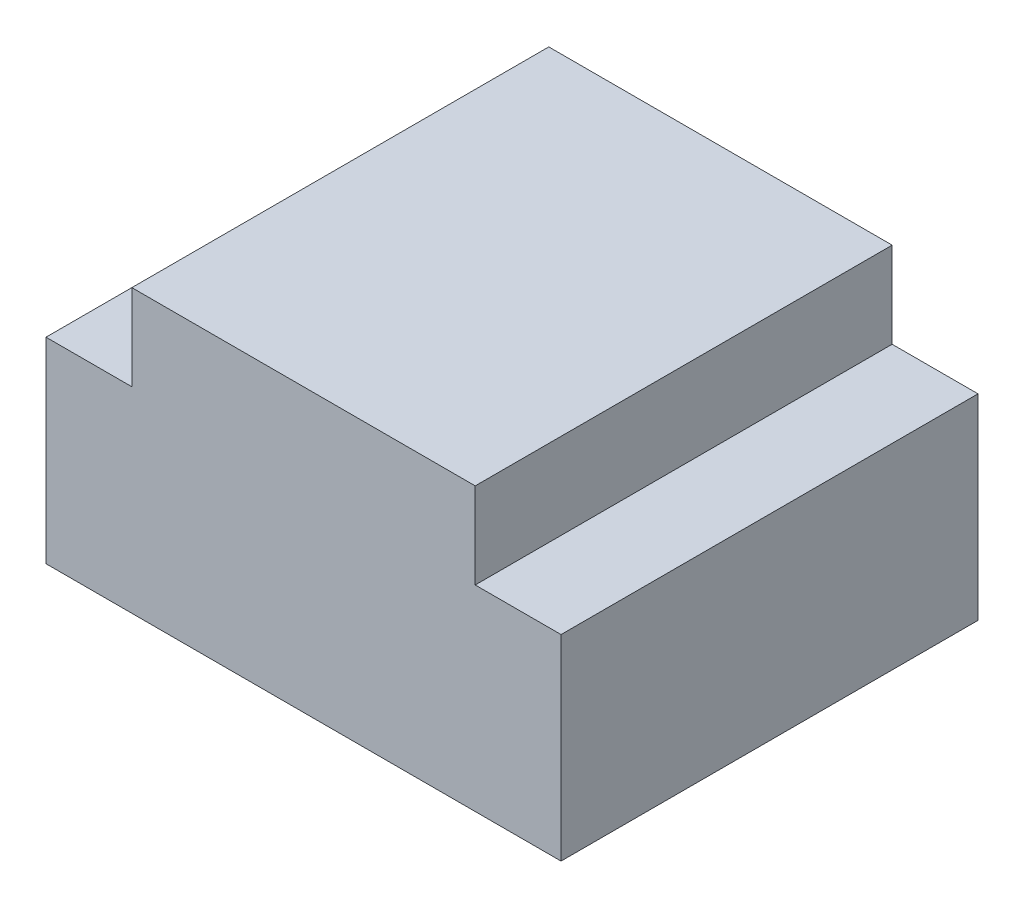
ISO-10303-21;
HEADER;
FILE_DESCRIPTION(('STEP AP214'),'2;1');
FILE_NAME('part.step','',(''),(''),'','','');
FILE_SCHEMA(('AUTOMOTIVE_DESIGN { 1 0 10303 214 1 1 1 1 }'));
ENDSEC;
DATA;
#1=APPLICATION_CONTEXT('core data for automotive mechanical design processes');
#2=APPLICATION_PROTOCOL_DEFINITION('international standard','automotive_design',2000,#1);
#3=PRODUCT_CONTEXT('',#1,'mechanical');
#4=PRODUCT('Part','Part','',(#3));
#5=PRODUCT_RELATED_PRODUCT_CATEGORY('part','',(#4));
#6=PRODUCT_DEFINITION_FORMATION('','',#4);
#7=PRODUCT_DEFINITION_CONTEXT('part definition',#1,'design');
#8=PRODUCT_DEFINITION('design','',#6,#7);
#9=PRODUCT_DEFINITION_SHAPE('','',#8);
#10=(LENGTH_UNIT() NAMED_UNIT(*) SI_UNIT(.MILLI.,.METRE.));
#11=(NAMED_UNIT(*) PLANE_ANGLE_UNIT() SI_UNIT($,.RADIAN.));
#12=(NAMED_UNIT(*) SI_UNIT($,.STERADIAN.) SOLID_ANGLE_UNIT());
#13=UNCERTAINTY_MEASURE_WITH_UNIT(LENGTH_MEASURE(1.E-05),#10,'distance_accuracy_value','');
#14=(GEOMETRIC_REPRESENTATION_CONTEXT(3) GLOBAL_UNCERTAINTY_ASSIGNED_CONTEXT((#13)) GLOBAL_UNIT_ASSIGNED_CONTEXT((#10,
#11,#12)) REPRESENTATION_CONTEXT('',''));
#15=CARTESIAN_POINT('',(0.,0.,0.));
#16=DIRECTION('',(0.,0.,1.));
#17=DIRECTION('',(1.,0.,0.));
#18=AXIS2_PLACEMENT_3D('',#15,#16,#17);
#19=CARTESIAN_POINT('',(-35.6336231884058,0.,8.89449275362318));
#20=DIRECTION('',(0.,1.,0.));
#21=DIRECTION('',(0.,0.,1.));
#22=AXIS2_PLACEMENT_3D('',#19,#20,#21);
#23=PLANE('',#22);
#24=DIRECTION('',(0.,0.,1.));
#25=VECTOR('',#24,1.);
#26=CARTESIAN_POINT('',(-35.6336231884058,0.,-25.1055072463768));
#27=LINE('',#26,#25);
#28=CARTESIAN_POINT('',(-35.6336231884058,0.,-25.1055072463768));
#29=VERTEX_POINT('',#28);
#30=CARTESIAN_POINT('',(-35.6336231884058,0.,8.89449275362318));
#31=VERTEX_POINT('',#30);
#32=EDGE_CURVE('E174',#29,#31,#27,.T.);
#33=ORIENTED_EDGE('',*,*,#32,.F.);
#34=DIRECTION('',(-1.,0.,0.));
#35=VECTOR('',#34,1.);
#36=CARTESIAN_POINT('',(-35.6336231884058,0.,-25.1055072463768));
#37=LINE('',#36,#35);
#38=CARTESIAN_POINT('',(6.3663768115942,0.,-25.1055072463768));
#39=VERTEX_POINT('',#38);
#40=EDGE_CURVE('E207',#39,#29,#37,.T.);
#41=ORIENTED_EDGE('',*,*,#40,.F.);
#42=DIRECTION('',(0.,0.,-1.));
#43=VECTOR('',#42,1.);
#44=CARTESIAN_POINT('',(6.3663768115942,0.,-25.1055072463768));
#45=LINE('',#44,#43);
#46=CARTESIAN_POINT('',(6.36637681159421,0.,8.89449275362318));
#47=VERTEX_POINT('',#46);
#48=EDGE_CURVE('E228',#47,#39,#45,.T.);
#49=ORIENTED_EDGE('',*,*,#48,.F.);
#50=DIRECTION('',(1.,0.,0.));
#51=VECTOR('',#50,1.);
#52=CARTESIAN_POINT('',(-35.6336231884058,0.,8.89449275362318));
#53=LINE('',#52,#51);
#54=EDGE_CURVE('E232',#31,#47,#53,.T.);
#55=ORIENTED_EDGE('',*,*,#54,.F.);
#56=EDGE_LOOP('',(#33,#41,#49,#55));
#57=FACE_BOUND('',#56,.T.);
#58=DIRECTION('',(0.,0.,-1.));
#59=VECTOR('',#58,1.);
#60=CARTESIAN_POINT('',(-28.6336231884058,0.,-18.1055072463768));
#61=LINE('',#60,#59);
#62=CARTESIAN_POINT('',(-28.6336231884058,0.,1.89449275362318));
#63=VERTEX_POINT('',#62);
#64=CARTESIAN_POINT('',(-28.6336231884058,0.,-18.1055072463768));
#65=VERTEX_POINT('',#64);
#66=EDGE_CURVE('E120',#63,#65,#61,.T.);
#67=ORIENTED_EDGE('',*,*,#66,.F.);
#68=DIRECTION('',(-1.,0.,0.));
#69=VECTOR('',#68,1.);
#70=CARTESIAN_POINT('',(-28.6336231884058,0.,1.89449275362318));
#71=LINE('',#70,#69);
#72=CARTESIAN_POINT('',(-0.633623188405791,0.,1.89449275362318));
#73=VERTEX_POINT('',#72);
#74=EDGE_CURVE('E122',#73,#63,#71,.T.);
#75=ORIENTED_EDGE('',*,*,#74,.F.);
#76=DIRECTION('',(0.,0.,1.));
#77=VECTOR('',#76,1.);
#78=CARTESIAN_POINT('',(-0.633623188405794,0.,1.89449275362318));
#79=LINE('',#78,#77);
#80=CARTESIAN_POINT('',(-0.633623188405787,0.,-18.1055072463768));
#81=VERTEX_POINT('',#80);
#82=EDGE_CURVE('E55',#81,#73,#79,.T.);
#83=ORIENTED_EDGE('',*,*,#82,.F.);
#84=DIRECTION('',(1.,0.,0.));
#85=VECTOR('',#84,1.);
#86=CARTESIAN_POINT('',(-0.633623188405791,0.,-18.1055072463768));
#87=LINE('',#86,#85);
#88=EDGE_CURVE('E50',#65,#81,#87,.T.);
#89=ORIENTED_EDGE('',*,*,#88,.F.);
#90=EDGE_LOOP('',(#67,#75,#83,#89));
#91=FACE_BOUND('',#90,.T.);
#92=ADVANCED_FACE('F33',(#57,#91),#23,.F.);
#93=CARTESIAN_POINT('',(-35.6336231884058,16.,8.89449275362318));
#94=DIRECTION('',(0.,1.,0.));
#95=DIRECTION('',(0.,0.,1.));
#96=AXIS2_PLACEMENT_3D('',#93,#94,#95);
#97=PLANE('',#96);
#98=DIRECTION('',(0.,0.,-1.));
#99=VECTOR('',#98,1.);
#100=CARTESIAN_POINT('',(-0.633623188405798,16.,8.89449275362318));
#101=LINE('',#100,#99);
#102=CARTESIAN_POINT('',(-0.633623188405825,16.,8.89449275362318));
#103=VERTEX_POINT('',#102);
#104=CARTESIAN_POINT('',(-0.633623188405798,16.,-25.1055072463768));
#105=VERTEX_POINT('',#104);
#106=EDGE_CURVE('E161',#103,#105,#101,.T.);
#107=ORIENTED_EDGE('',*,*,#106,.F.);
#108=DIRECTION('',(1.,0.,0.));
#109=VECTOR('',#108,1.);
#110=CARTESIAN_POINT('',(-35.6336231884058,16.,8.89449275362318));
#111=LINE('',#110,#109);
#112=CARTESIAN_POINT('',(6.36637681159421,16.,8.89449275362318));
#113=VERTEX_POINT('',#112);
#114=EDGE_CURVE('E197',#103,#113,#111,.T.);
#115=ORIENTED_EDGE('',*,*,#114,.T.);
#116=DIRECTION('',(0.,0.,-1.));
#117=VECTOR('',#116,1.);
#118=CARTESIAN_POINT('',(6.3663768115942,16.,-25.1055072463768));
#119=LINE('',#118,#117);
#120=CARTESIAN_POINT('',(6.3663768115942,16.,-25.1055072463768));
#121=VERTEX_POINT('',#120);
#122=EDGE_CURVE('E204',#113,#121,#119,.T.);
#123=ORIENTED_EDGE('',*,*,#122,.T.);
#124=DIRECTION('',(-1.,0.,0.));
#125=VECTOR('',#124,1.);
#126=CARTESIAN_POINT('',(-35.6336231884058,16.,-25.1055072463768));
#127=LINE('',#126,#125);
#128=EDGE_CURVE('E210',#121,#105,#127,.T.);
#129=ORIENTED_EDGE('',*,*,#128,.T.);
#130=EDGE_LOOP('',(#107,#115,#123,#129));
#131=FACE_BOUND('',#130,.T.);
#132=ADVANCED_FACE('F259',(#131),#97,.T.);
#133=CARTESIAN_POINT('',(-35.6336231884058,16.,-25.1055072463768));
#134=DIRECTION('',(1.,0.,0.));
#135=DIRECTION('',(0.,0.,-1.));
#136=AXIS2_PLACEMENT_3D('',#133,#134,#135);
#137=PLANE('',#136);
#138=ORIENTED_EDGE('',*,*,#32,.T.);
#139=DIRECTION('',(0.,-1.,0.));
#140=VECTOR('',#139,1.);
#141=CARTESIAN_POINT('',(-35.6336231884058,16.,8.89449275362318));
#142=LINE('',#141,#140);
#143=CARTESIAN_POINT('',(-35.6336231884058,16.,8.89449275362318));
#144=VERTEX_POINT('',#143);
#145=EDGE_CURVE('E11',#144,#31,#142,.T.);
#146=ORIENTED_EDGE('',*,*,#145,.F.);
#147=DIRECTION('',(0.,0.,1.));
#148=VECTOR('',#147,1.);
#149=CARTESIAN_POINT('',(-35.6336231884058,16.,-25.1055072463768));
#150=LINE('',#149,#148);
#151=CARTESIAN_POINT('',(-35.6336231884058,16.,-25.1055072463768));
#152=VERTEX_POINT('',#151);
#153=EDGE_CURVE('E202',#152,#144,#150,.T.);
#154=ORIENTED_EDGE('',*,*,#153,.F.);
#155=DIRECTION('',(0.,-1.,0.));
#156=VECTOR('',#155,1.);
#157=CARTESIAN_POINT('',(-35.6336231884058,16.,-25.1055072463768));
#158=LINE('',#157,#156);
#159=EDGE_CURVE('E217',#152,#29,#158,.T.);
#160=ORIENTED_EDGE('',*,*,#159,.T.);
#161=EDGE_LOOP('',(#138,#146,#154,#160));
#162=FACE_BOUND('',#161,.T.);
#163=ADVANCED_FACE('F35',(#162),#137,.F.);
#164=CARTESIAN_POINT('',(-35.6336231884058,16.,8.89449275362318));
#165=DIRECTION('',(0.,0.,-1.));
#166=DIRECTION('',(-1.,0.,0.));
#167=AXIS2_PLACEMENT_3D('',#164,#165,#166);
#168=PLANE('',#167);
#169=ORIENTED_EDGE('',*,*,#54,.T.);
#170=DIRECTION('',(0.,-1.,0.));
#171=VECTOR('',#170,1.);
#172=CARTESIAN_POINT('',(6.36637681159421,16.,8.89449275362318));
#173=LINE('',#172,#171);
#174=EDGE_CURVE('E42',#113,#47,#173,.T.);
#175=ORIENTED_EDGE('',*,*,#174,.F.);
#176=ORIENTED_EDGE('',*,*,#114,.F.);
#177=DIRECTION('',(0.,-1.,0.));
#178=VECTOR('',#177,1.);
#179=CARTESIAN_POINT('',(-0.633623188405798,23.,8.89449275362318));
#180=LINE('',#179,#178);
#181=CARTESIAN_POINT('',(-0.633623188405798,23.,8.89449275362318));
#182=VERTEX_POINT('',#181);
#183=EDGE_CURVE('E169',#182,#103,#180,.T.);
#184=ORIENTED_EDGE('',*,*,#183,.F.);
#185=DIRECTION('',(1.,0.,0.));
#186=VECTOR('',#185,1.);
#187=CARTESIAN_POINT('',(-28.6336231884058,23.,8.89449275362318));
#188=LINE('',#187,#186);
#189=CARTESIAN_POINT('',(-28.6336231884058,23.,8.89449275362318));
#190=VERTEX_POINT('',#189);
#191=EDGE_CURVE('E195',#190,#182,#188,.T.);
#192=ORIENTED_EDGE('',*,*,#191,.F.);
#193=DIRECTION('',(0.,-1.,0.));
#194=VECTOR('',#193,1.);
#195=CARTESIAN_POINT('',(-28.6336231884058,23.,8.89449275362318));
#196=LINE('',#195,#194);
#197=CARTESIAN_POINT('',(-28.6336231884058,16.,8.89449275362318));
#198=VERTEX_POINT('',#197);
#199=EDGE_CURVE('E165',#190,#198,#196,.T.);
#200=ORIENTED_EDGE('',*,*,#199,.T.);
#201=EDGE_CURVE('E201',#144,#198,#111,.T.);
#202=ORIENTED_EDGE('',*,*,#201,.F.);
#203=ORIENTED_EDGE('',*,*,#145,.T.);
#204=EDGE_LOOP('',(#169,#175,#176,#184,#192,#200,#202,#203));
#205=FACE_BOUND('',#204,.T.);
#206=ADVANCED_FACE('F194',(#205),#168,.F.);
#207=CARTESIAN_POINT('',(6.3663768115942,16.,-25.1055072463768));
#208=DIRECTION('',(-1.,0.,0.));
#209=DIRECTION('',(0.,0.,1.));
#210=AXIS2_PLACEMENT_3D('',#207,#208,#209);
#211=PLANE('',#210);
#212=ORIENTED_EDGE('',*,*,#48,.T.);
#213=DIRECTION('',(0.,-1.,0.));
#214=VECTOR('',#213,1.);
#215=CARTESIAN_POINT('',(6.3663768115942,16.,-25.1055072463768));
#216=LINE('',#215,#214);
#217=EDGE_CURVE('E221',#121,#39,#216,.T.);
#218=ORIENTED_EDGE('',*,*,#217,.F.);
#219=ORIENTED_EDGE('',*,*,#122,.F.);
#220=ORIENTED_EDGE('',*,*,#174,.T.);
#221=EDGE_LOOP('',(#212,#218,#219,#220));
#222=FACE_BOUND('',#221,.T.);
#223=ADVANCED_FACE('F226',(#222),#211,.F.);
#224=CARTESIAN_POINT('',(-35.6336231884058,16.,-25.1055072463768));
#225=DIRECTION('',(0.,0.,1.));
#226=DIRECTION('',(1.,0.,0.));
#227=AXIS2_PLACEMENT_3D('',#224,#225,#226);
#228=PLANE('',#227);
#229=ORIENTED_EDGE('',*,*,#40,.T.);
#230=ORIENTED_EDGE('',*,*,#159,.F.);
#231=CARTESIAN_POINT('',(-28.6336231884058,16.,-25.1055072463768));
#232=VERTEX_POINT('',#231);
#233=EDGE_CURVE('E162',#232,#152,#127,.T.);
#234=ORIENTED_EDGE('',*,*,#233,.F.);
#235=DIRECTION('',(0.,-1.,0.));
#236=VECTOR('',#235,1.);
#237=CARTESIAN_POINT('',(-28.6336231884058,23.,-25.1055072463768));
#238=LINE('',#237,#236);
#239=CARTESIAN_POINT('',(-28.6336231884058,23.,-25.1055072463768));
#240=VERTEX_POINT('',#239);
#241=EDGE_CURVE('E168',#240,#232,#238,.T.);
#242=ORIENTED_EDGE('',*,*,#241,.F.);
#243=DIRECTION('',(-1.,0.,0.));
#244=VECTOR('',#243,1.);
#245=CARTESIAN_POINT('',(-0.633623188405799,23.,-25.1055072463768));
#246=LINE('',#245,#244);
#247=CARTESIAN_POINT('',(-0.633623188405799,23.,-25.1055072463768));
#248=VERTEX_POINT('',#247);
#249=EDGE_CURVE('E179',#248,#240,#246,.T.);
#250=ORIENTED_EDGE('',*,*,#249,.F.);
#251=DIRECTION('',(0.,-1.,0.));
#252=VECTOR('',#251,1.);
#253=CARTESIAN_POINT('',(-0.633623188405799,23.,-25.1055072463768));
#254=LINE('',#253,#252);
#255=EDGE_CURVE('E180',#248,#105,#254,.T.);
#256=ORIENTED_EDGE('',*,*,#255,.T.);
#257=ORIENTED_EDGE('',*,*,#128,.F.);
#258=ORIENTED_EDGE('',*,*,#217,.T.);
#259=EDGE_LOOP('',(#229,#230,#234,#242,#250,#256,#257,#258));
#260=FACE_BOUND('',#259,.T.);
#261=ADVANCED_FACE('F249',(#260),#228,.F.);
#262=DIRECTION('',(0.,0.,1.));
#263=VECTOR('',#262,1.);
#264=CARTESIAN_POINT('',(-28.6336231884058,16.,-25.1055072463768));
#265=LINE('',#264,#263);
#266=EDGE_CURVE('E152',#232,#198,#265,.T.);
#267=ORIENTED_EDGE('',*,*,#266,.F.);
#268=ORIENTED_EDGE('',*,*,#233,.T.);
#269=ORIENTED_EDGE('',*,*,#153,.T.);
#270=ORIENTED_EDGE('',*,*,#201,.T.);
#271=EDGE_LOOP('',(#267,#268,#269,#270));
#272=FACE_BOUND('',#271,.T.);
#273=ADVANCED_FACE('F256',(#272),#97,.T.);
#274=CARTESIAN_POINT('',(-28.6336231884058,23.,-25.1055072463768));
#275=DIRECTION('',(1.,0.,0.));
#276=DIRECTION('',(0.,0.,-1.));
#277=AXIS2_PLACEMENT_3D('',#274,#275,#276);
#278=PLANE('',#277);
#279=ORIENTED_EDGE('',*,*,#266,.T.);
#280=ORIENTED_EDGE('',*,*,#199,.F.);
#281=DIRECTION('',(0.,0.,1.));
#282=VECTOR('',#281,1.);
#283=CARTESIAN_POINT('',(-28.6336231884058,23.,-25.1055072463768));
#284=LINE('',#283,#282);
#285=EDGE_CURVE('E240',#240,#190,#284,.T.);
#286=ORIENTED_EDGE('',*,*,#285,.F.);
#287=ORIENTED_EDGE('',*,*,#241,.T.);
#288=EDGE_LOOP('',(#279,#280,#286,#287));
#289=FACE_BOUND('',#288,.T.);
#290=ADVANCED_FACE('F252',(#289),#278,.F.);
#291=CARTESIAN_POINT('',(-0.633623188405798,23.,8.89449275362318));
#292=DIRECTION('',(-1.,0.,0.));
#293=DIRECTION('',(0.,0.,1.));
#294=AXIS2_PLACEMENT_3D('',#291,#292,#293);
#295=PLANE('',#294);
#296=ORIENTED_EDGE('',*,*,#106,.T.);
#297=ORIENTED_EDGE('',*,*,#255,.F.);
#298=DIRECTION('',(0.,0.,-1.));
#299=VECTOR('',#298,1.);
#300=CARTESIAN_POINT('',(-0.633623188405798,23.,8.89449275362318));
#301=LINE('',#300,#299);
#302=EDGE_CURVE('E183',#182,#248,#301,.T.);
#303=ORIENTED_EDGE('',*,*,#302,.F.);
#304=ORIENTED_EDGE('',*,*,#183,.T.);
#305=EDGE_LOOP('',(#296,#297,#303,#304));
#306=FACE_BOUND('',#305,.T.);
#307=ADVANCED_FACE('F189',(#306),#295,.F.);
#308=CARTESIAN_POINT('',(-28.6336231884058,23.,-25.1055072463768));
#309=DIRECTION('',(0.,1.,0.));
#310=DIRECTION('',(0.,0.,1.));
#311=AXIS2_PLACEMENT_3D('',#308,#309,#310);
#312=PLANE('',#311);
#313=ORIENTED_EDGE('',*,*,#249,.T.);
#314=ORIENTED_EDGE('',*,*,#285,.T.);
#315=ORIENTED_EDGE('',*,*,#191,.T.);
#316=ORIENTED_EDGE('',*,*,#302,.T.);
#317=EDGE_LOOP('',(#313,#314,#315,#316));
#318=FACE_BOUND('',#317,.T.);
#319=ADVANCED_FACE('F245',(#318),#312,.T.);
#320=CARTESIAN_POINT('',(-28.6336231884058,-6.5,-18.1055072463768));
#321=DIRECTION('',(1.,0.,0.));
#322=DIRECTION('',(0.,0.,-1.));
#323=AXIS2_PLACEMENT_3D('',#320,#321,#322);
#324=PLANE('',#323);
#325=ORIENTED_EDGE('',*,*,#66,.T.);
#326=DIRECTION('',(0.,1.,0.));
#327=VECTOR('',#326,1.);
#328=CARTESIAN_POINT('',(-28.6336231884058,-6.5,-18.1055072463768));
#329=LINE('',#328,#327);
#330=CARTESIAN_POINT('',(-28.6336231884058,-6.5,-18.1055072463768));
#331=VERTEX_POINT('',#330);
#332=EDGE_CURVE('E150',#331,#65,#329,.T.);
#333=ORIENTED_EDGE('',*,*,#332,.F.);
#334=DIRECTION('',(0.,0.,-1.));
#335=VECTOR('',#334,1.);
#336=CARTESIAN_POINT('',(-28.6336231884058,-6.5,-18.1055072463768));
#337=LINE('',#336,#335);
#338=CARTESIAN_POINT('',(-28.6336231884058,-6.5,1.89449275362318));
#339=VERTEX_POINT('',#338);
#340=EDGE_CURVE('E136',#339,#331,#337,.T.);
#341=ORIENTED_EDGE('',*,*,#340,.F.);
#342=DIRECTION('',(0.,1.,0.));
#343=VECTOR('',#342,1.);
#344=CARTESIAN_POINT('',(-28.6336231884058,-6.5,1.89449275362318));
#345=LINE('',#344,#343);
#346=EDGE_CURVE('E132',#339,#63,#345,.T.);
#347=ORIENTED_EDGE('',*,*,#346,.T.);
#348=EDGE_LOOP('',(#325,#333,#341,#347));
#349=FACE_BOUND('',#348,.T.);
#350=ADVANCED_FACE('F138',(#349),#324,.F.);
#351=CARTESIAN_POINT('',(-0.633623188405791,-6.5,-18.1055072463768));
#352=DIRECTION('',(0.,0.,1.));
#353=DIRECTION('',(1.,0.,0.));
#354=AXIS2_PLACEMENT_3D('',#351,#352,#353);
#355=PLANE('',#354);
#356=ORIENTED_EDGE('',*,*,#88,.T.);
#357=DIRECTION('',(0.,1.,0.));
#358=VECTOR('',#357,1.);
#359=CARTESIAN_POINT('',(-0.633623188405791,-6.5,-18.1055072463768));
#360=LINE('',#359,#358);
#361=CARTESIAN_POINT('',(-0.633623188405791,-6.5,-18.1055072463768));
#362=VERTEX_POINT('',#361);
#363=EDGE_CURVE('E142',#362,#81,#360,.T.);
#364=ORIENTED_EDGE('',*,*,#363,.F.);
#365=DIRECTION('',(1.,0.,0.));
#366=VECTOR('',#365,1.);
#367=CARTESIAN_POINT('',(-0.633623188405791,-6.5,-18.1055072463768));
#368=LINE('',#367,#366);
#369=EDGE_CURVE('E385',#331,#362,#368,.T.);
#370=ORIENTED_EDGE('',*,*,#369,.F.);
#371=ORIENTED_EDGE('',*,*,#332,.T.);
#372=EDGE_LOOP('',(#356,#364,#370,#371));
#373=FACE_BOUND('',#372,.T.);
#374=ADVANCED_FACE('F342',(#373),#355,.F.);
#375=CARTESIAN_POINT('',(-0.633623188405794,-6.5,1.89449275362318));
#376=DIRECTION('',(-1.,0.,0.));
#377=DIRECTION('',(0.,0.,1.));
#378=AXIS2_PLACEMENT_3D('',#375,#376,#377);
#379=PLANE('',#378);
#380=ORIENTED_EDGE('',*,*,#82,.T.);
#381=DIRECTION('',(0.,1.,0.));
#382=VECTOR('',#381,1.);
#383=CARTESIAN_POINT('',(-0.633623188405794,-6.5,1.89449275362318));
#384=LINE('',#383,#382);
#385=CARTESIAN_POINT('',(-0.633623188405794,-6.5,1.89449275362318));
#386=VERTEX_POINT('',#385);
#387=EDGE_CURVE('E135',#386,#73,#384,.T.);
#388=ORIENTED_EDGE('',*,*,#387,.F.);
#389=DIRECTION('',(0.,0.,1.));
#390=VECTOR('',#389,1.);
#391=CARTESIAN_POINT('',(-0.633623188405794,-6.5,1.89449275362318));
#392=LINE('',#391,#390);
#393=EDGE_CURVE('E144',#362,#386,#392,.T.);
#394=ORIENTED_EDGE('',*,*,#393,.F.);
#395=ORIENTED_EDGE('',*,*,#363,.T.);
#396=EDGE_LOOP('',(#380,#388,#394,#395));
#397=FACE_BOUND('',#396,.T.);
#398=ADVANCED_FACE('F350',(#397),#379,.F.);
#399=CARTESIAN_POINT('',(-28.6336231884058,-6.5,1.89449275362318));
#400=DIRECTION('',(0.,0.,-1.));
#401=DIRECTION('',(-1.,0.,0.));
#402=AXIS2_PLACEMENT_3D('',#399,#400,#401);
#403=PLANE('',#402);
#404=ORIENTED_EDGE('',*,*,#74,.T.);
#405=ORIENTED_EDGE('',*,*,#346,.F.);
#406=DIRECTION('',(-1.,0.,0.));
#407=VECTOR('',#406,1.);
#408=CARTESIAN_POINT('',(-28.6336231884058,-6.5,1.89449275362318));
#409=LINE('',#408,#407);
#410=EDGE_CURVE('E140',#386,#339,#409,.T.);
#411=ORIENTED_EDGE('',*,*,#410,.F.);
#412=ORIENTED_EDGE('',*,*,#387,.T.);
#413=EDGE_LOOP('',(#404,#405,#411,#412));
#414=FACE_BOUND('',#413,.T.);
#415=ADVANCED_FACE('F130',(#414),#403,.F.);
#416=CARTESIAN_POINT('',(-28.6336231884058,-6.5,1.89449275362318));
#417=DIRECTION('',(0.,1.,0.));
#418=DIRECTION('',(0.,0.,1.));
#419=AXIS2_PLACEMENT_3D('',#416,#417,#418);
#420=PLANE('',#419);
#421=ORIENTED_EDGE('',*,*,#340,.T.);
#422=ORIENTED_EDGE('',*,*,#369,.T.);
#423=ORIENTED_EDGE('',*,*,#393,.T.);
#424=ORIENTED_EDGE('',*,*,#410,.T.);
#425=EDGE_LOOP('',(#421,#422,#423,#424));
#426=FACE_BOUND('',#425,.T.);
#427=ADVANCED_FACE('F367',(#426),#420,.F.);
#428=CLOSED_SHELL('',(#92,#132,#163,#206,#223,#261,#273,#290,#307,#319,#350,#374,#398,#415,#427));
#429=MANIFOLD_SOLID_BREP('B2',#428);
#430=ADVANCED_BREP_SHAPE_REPRESENTATION('',(#18,#429),#14);
#431=SHAPE_DEFINITION_REPRESENTATION(#9,#430);
ENDSEC;
END-ISO-10303-21;
